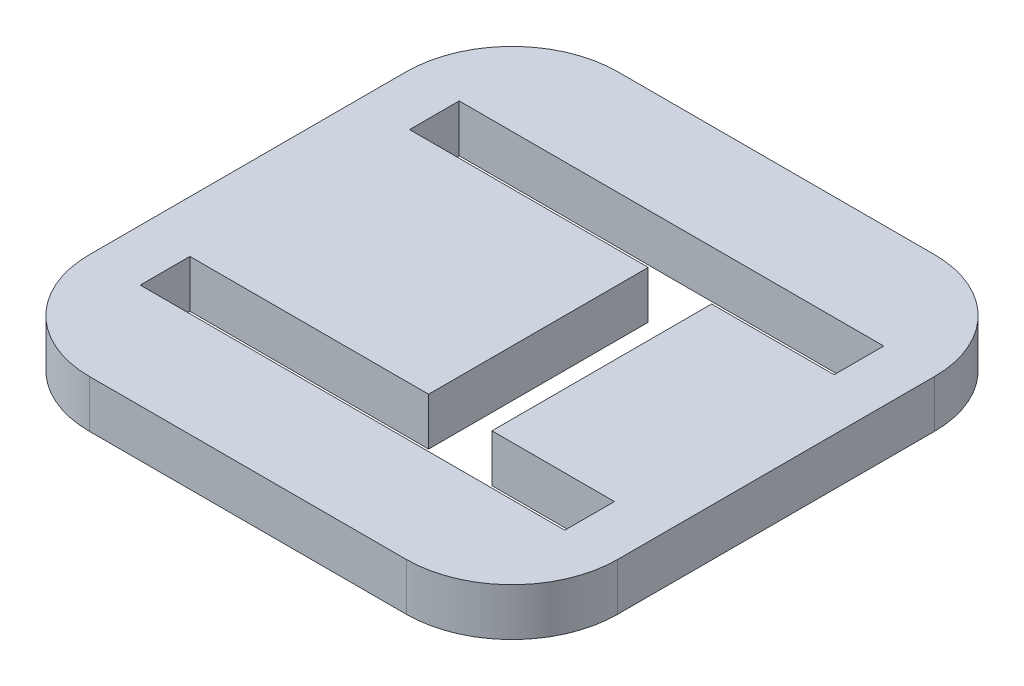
from build123d import *

# Parameters (mm, degrees)
BOSS_EXTRU_1_DEPTH = 9


with BuildPart() as part:
    # Esquisse1 → Boss.-Extru.1 (new body)
    with BuildSketch(Plane(origin=(0, 0, 0), x_dir=(1, 0, 0), z_dir=(0, 1, 0))):
        with BuildLine():
            Line((-65, -50), (-5, -50))
            ThreePointArc((-5, -50), (9.142135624, -44.142135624), (15, -30))
            Line((15, -30), (15, 30))
            ThreePointArc((15, 30), (9.142135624, 44.142135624), (-5, 50))
            Line((-5, 50), (-65, 50))
            ThreePointArc((-65, 50), (-79.142135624, 44.142135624), (-85, 30))
            Line((-85, 30), (-85, -30))
            ThreePointArc((-85, -30), (-79.142135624, -44.142135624), (-65, -50))
        make_face()
        Polygon((-75.2, -30.2), (5.2, -30.2), (5.2, -20.8), (-18, -20.8), (-18, 20.8), (5.2, 20.8), (5.2, 30.2), (-75.2, 30.2), (-75.2, 20.8), (-30, 20.8), (-30, -20.8), (-75.2, -20.8), align=None, mode=Mode.SUBTRACT)
    extrude(amount=-BOSS_EXTRU_1_DEPTH)


solid = part.part
